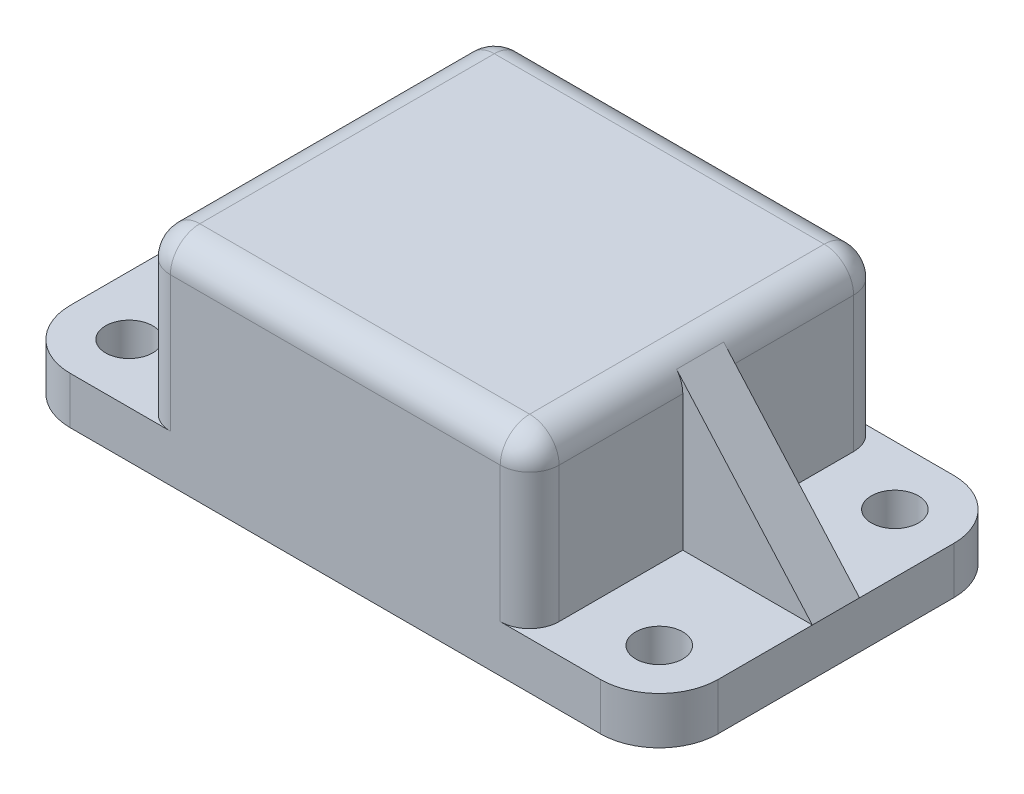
ISO-10303-21;
HEADER;
FILE_DESCRIPTION(('STEP AP214'),'2;1');
FILE_NAME('part.step','',(''),(''),'','','');
FILE_SCHEMA(('AUTOMOTIVE_DESIGN { 1 0 10303 214 1 1 1 1 }'));
ENDSEC;
DATA;
#1=APPLICATION_CONTEXT('core data for automotive mechanical design processes');
#2=APPLICATION_PROTOCOL_DEFINITION('international standard','automotive_design',2000,#1);
#3=PRODUCT_CONTEXT('',#1,'mechanical');
#4=PRODUCT('Part','Part','',(#3));
#5=PRODUCT_RELATED_PRODUCT_CATEGORY('part','',(#4));
#6=PRODUCT_DEFINITION_FORMATION('','',#4);
#7=PRODUCT_DEFINITION_CONTEXT('part definition',#1,'design');
#8=PRODUCT_DEFINITION('design','',#6,#7);
#9=PRODUCT_DEFINITION_SHAPE('','',#8);
#10=(LENGTH_UNIT() NAMED_UNIT(*) SI_UNIT(.MILLI.,.METRE.));
#11=(NAMED_UNIT(*) PLANE_ANGLE_UNIT() SI_UNIT($,.RADIAN.));
#12=(NAMED_UNIT(*) SI_UNIT($,.STERADIAN.) SOLID_ANGLE_UNIT());
#13=UNCERTAINTY_MEASURE_WITH_UNIT(LENGTH_MEASURE(1.E-05),#10,'distance_accuracy_value','');
#14=(GEOMETRIC_REPRESENTATION_CONTEXT(3) GLOBAL_UNCERTAINTY_ASSIGNED_CONTEXT((#13)) GLOBAL_UNIT_ASSIGNED_CONTEXT((#10,
#11,#12)) REPRESENTATION_CONTEXT('',''));
#15=CARTESIAN_POINT('',(0.,0.,0.));
#16=DIRECTION('',(0.,0.,1.));
#17=DIRECTION('',(1.,0.,0.));
#18=AXIS2_PLACEMENT_3D('',#15,#16,#17);
#19=CARTESIAN_POINT('',(-55.,0.,30.));
#20=DIRECTION('',(0.,1.,0.));
#21=DIRECTION('',(0.,0.,1.));
#22=AXIS2_PLACEMENT_3D('',#19,#20,#21);
#23=PLANE('',#22);
#24=CARTESIAN_POINT('',(-45.,0.,-20.));
#25=DIRECTION('',(0.,1.,0.));
#26=DIRECTION('',(0.,0.,1.));
#27=AXIS2_PLACEMENT_3D('',#24,#25,#26);
#28=CIRCLE('',#27,4.00000000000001);
#29=CARTESIAN_POINT('',(-45.,0.,-16.));
#30=VERTEX_POINT('',#29);
#31=EDGE_CURVE('E317',#30,#30,#28,.T.);
#32=ORIENTED_EDGE('',*,*,#31,.T.);
#33=EDGE_LOOP('',(#32));
#34=FACE_BOUND('',#33,.T.);
#35=CARTESIAN_POINT('',(45.,0.,-20.));
#36=DIRECTION('',(0.,1.,0.));
#37=DIRECTION('',(0.,0.,1.));
#38=AXIS2_PLACEMENT_3D('',#35,#36,#37);
#39=CIRCLE('',#38,4.00000000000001);
#40=CARTESIAN_POINT('',(45.,0.,-16.));
#41=VERTEX_POINT('',#40);
#42=EDGE_CURVE('E305',#41,#41,#39,.T.);
#43=ORIENTED_EDGE('',*,*,#42,.T.);
#44=EDGE_LOOP('',(#43));
#45=FACE_BOUND('',#44,.T.);
#46=DIRECTION('',(0.,0.,-1.));
#47=VECTOR('',#46,1.);
#48=CARTESIAN_POINT('',(-55.,0.,30.));
#49=LINE('',#48,#47);
#50=CARTESIAN_POINT('',(-55.,0.,20.));
#51=VERTEX_POINT('',#50);
#52=CARTESIAN_POINT('',(-55.,0.,-20.));
#53=VERTEX_POINT('',#52);
#54=EDGE_CURVE('E364',#51,#53,#49,.T.);
#55=ORIENTED_EDGE('',*,*,#54,.T.);
#56=CARTESIAN_POINT('',(-45.,0.,-20.));
#57=DIRECTION('',(0.,1.,0.));
#58=DIRECTION('',(0.,0.,1.));
#59=AXIS2_PLACEMENT_3D('',#56,#57,#58);
#60=CIRCLE('',#59,10.);
#61=CARTESIAN_POINT('',(-45.,0.,-30.));
#62=VERTEX_POINT('',#61);
#63=EDGE_CURVE('E379',#53,#62,#60,.F.);
#64=ORIENTED_EDGE('',*,*,#63,.T.);
#65=DIRECTION('',(1.,0.,0.));
#66=VECTOR('',#65,1.);
#67=CARTESIAN_POINT('',(-55.,0.,-30.));
#68=LINE('',#67,#66);
#69=CARTESIAN_POINT('',(45.,0.,-30.));
#70=VERTEX_POINT('',#69);
#71=EDGE_CURVE('E339',#62,#70,#68,.T.);
#72=ORIENTED_EDGE('',*,*,#71,.T.);
#73=CARTESIAN_POINT('',(45.,0.,-20.));
#74=DIRECTION('',(0.,1.,0.));
#75=DIRECTION('',(0.,0.,1.));
#76=AXIS2_PLACEMENT_3D('',#73,#74,#75);
#77=CIRCLE('',#76,10.);
#78=CARTESIAN_POINT('',(55.,0.,-20.));
#79=VERTEX_POINT('',#78);
#80=EDGE_CURVE('E385',#70,#79,#77,.F.);
#81=ORIENTED_EDGE('',*,*,#80,.T.);
#82=DIRECTION('',(0.,0.,-1.));
#83=VECTOR('',#82,1.);
#84=CARTESIAN_POINT('',(55.,0.,30.));
#85=LINE('',#84,#83);
#86=CARTESIAN_POINT('',(55.,0.,20.));
#87=VERTEX_POINT('',#86);
#88=EDGE_CURVE('E362',#87,#79,#85,.T.);
#89=ORIENTED_EDGE('',*,*,#88,.F.);
#90=CARTESIAN_POINT('',(45.,0.,20.));
#91=DIRECTION('',(0.,1.,0.));
#92=DIRECTION('',(0.,0.,1.));
#93=AXIS2_PLACEMENT_3D('',#90,#91,#92);
#94=CIRCLE('',#93,10.);
#95=CARTESIAN_POINT('',(45.,0.,30.));
#96=VERTEX_POINT('',#95);
#97=EDGE_CURVE('E383',#87,#96,#94,.F.);
#98=ORIENTED_EDGE('',*,*,#97,.T.);
#99=DIRECTION('',(1.,0.,0.));
#100=VECTOR('',#99,1.);
#101=CARTESIAN_POINT('',(-55.,0.,30.));
#102=LINE('',#101,#100);
#103=CARTESIAN_POINT('',(-45.,0.,30.));
#104=VERTEX_POINT('',#103);
#105=EDGE_CURVE('E329',#104,#96,#102,.T.);
#106=ORIENTED_EDGE('',*,*,#105,.F.);
#107=CARTESIAN_POINT('',(-45.,0.,20.));
#108=DIRECTION('',(0.,1.,0.));
#109=DIRECTION('',(0.,0.,1.));
#110=AXIS2_PLACEMENT_3D('',#107,#108,#109);
#111=CIRCLE('',#110,10.);
#112=EDGE_CURVE('E381',#104,#51,#111,.F.);
#113=ORIENTED_EDGE('',*,*,#112,.T.);
#114=EDGE_LOOP('',(#55,#64,#72,#81,#89,#98,#106,#113));
#115=FACE_BOUND('',#114,.T.);
#116=CARTESIAN_POINT('',(-45.,0.,20.));
#117=DIRECTION('',(0.,1.,0.));
#118=DIRECTION('',(0.,0.,1.));
#119=AXIS2_PLACEMENT_3D('',#116,#117,#118);
#120=CIRCLE('',#119,4.00000000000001);
#121=CARTESIAN_POINT('',(-45.,0.,24.));
#122=VERTEX_POINT('',#121);
#123=EDGE_CURVE('E323',#122,#122,#120,.T.);
#124=ORIENTED_EDGE('',*,*,#123,.T.);
#125=EDGE_LOOP('',(#124));
#126=FACE_BOUND('',#125,.T.);
#127=CARTESIAN_POINT('',(45.,0.,20.));
#128=DIRECTION('',(0.,1.,0.));
#129=DIRECTION('',(0.,0.,1.));
#130=AXIS2_PLACEMENT_3D('',#127,#128,#129);
#131=CIRCLE('',#130,4.00000000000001);
#132=CARTESIAN_POINT('',(45.,0.,24.));
#133=VERTEX_POINT('',#132);
#134=EDGE_CURVE('E311',#133,#133,#131,.T.);
#135=ORIENTED_EDGE('',*,*,#134,.T.);
#136=EDGE_LOOP('',(#135));
#137=FACE_BOUND('',#136,.T.);
#138=DIRECTION('',(0.,0.,1.));
#139=VECTOR('',#138,1.);
#140=CARTESIAN_POINT('',(-26.,0.,-24.));
#141=LINE('',#140,#139);
#142=CARTESIAN_POINT('',(-26.,0.,-24.));
#143=VERTEX_POINT('',#142);
#144=CARTESIAN_POINT('',(-26.,0.,24.));
#145=VERTEX_POINT('',#144);
#146=EDGE_CURVE('E51',#143,#145,#141,.T.);
#147=ORIENTED_EDGE('',*,*,#146,.T.);
#148=DIRECTION('',(1.,0.,0.));
#149=VECTOR('',#148,1.);
#150=CARTESIAN_POINT('',(-26.,0.,24.));
#151=LINE('',#150,#149);
#152=CARTESIAN_POINT('',(26.,0.,24.));
#153=VERTEX_POINT('',#152);
#154=EDGE_CURVE('E252',#145,#153,#151,.T.);
#155=ORIENTED_EDGE('',*,*,#154,.T.);
#156=DIRECTION('',(0.,0.,1.));
#157=VECTOR('',#156,1.);
#158=CARTESIAN_POINT('',(26.,0.,-24.));
#159=LINE('',#158,#157);
#160=CARTESIAN_POINT('',(26.,0.,-24.));
#161=VERTEX_POINT('',#160);
#162=EDGE_CURVE('E1021',#161,#153,#159,.T.);
#163=ORIENTED_EDGE('',*,*,#162,.F.);
#164=DIRECTION('',(1.,0.,0.));
#165=VECTOR('',#164,1.);
#166=CARTESIAN_POINT('',(-26.,0.,-24.));
#167=LINE('',#166,#165);
#168=EDGE_CURVE('E248',#143,#161,#167,.T.);
#169=ORIENTED_EDGE('',*,*,#168,.F.);
#170=EDGE_LOOP('',(#147,#155,#163,#169));
#171=FACE_BOUND('',#170,.T.);
#172=ADVANCED_FACE('F36',(#34,#45,#115,#126,#137,#171),#23,.F.);
#173=CARTESIAN_POINT('',(55.,8.,30.));
#174=DIRECTION('',(0.,-1.,0.));
#175=DIRECTION('',(1.,0.,0.));
#176=AXIS2_PLACEMENT_3D('',#173,#174,#175);
#177=PLANE('',#176);
#178=CARTESIAN_POINT('',(45.,8.00000000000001,-20.));
#179=DIRECTION('',(0.,1.,0.));
#180=DIRECTION('',(0.,0.,1.));
#181=AXIS2_PLACEMENT_3D('',#178,#179,#180);
#182=CIRCLE('',#181,4.00000000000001);
#183=CARTESIAN_POINT('',(45.,8.00000000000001,-16.));
#184=VERTEX_POINT('',#183);
#185=EDGE_CURVE('E304',#184,#184,#182,.T.);
#186=ORIENTED_EDGE('',*,*,#185,.F.);
#187=EDGE_LOOP('',(#186));
#188=FACE_BOUND('',#187,.T.);
#189=DIRECTION('',(-1.,0.,0.));
#190=VECTOR('',#189,1.);
#191=CARTESIAN_POINT('',(55.,8.,-4.));
#192=LINE('',#191,#190);
#193=CARTESIAN_POINT('',(55.,8.,-4.));
#194=VERTEX_POINT('',#193);
#195=CARTESIAN_POINT('',(33.,8.,-4.));
#196=VERTEX_POINT('',#195);
#197=EDGE_CURVE('E264',#194,#196,#192,.T.);
#198=ORIENTED_EDGE('',*,*,#197,.F.);
#199=DIRECTION('',(0.,0.,-1.));
#200=VECTOR('',#199,1.);
#201=CARTESIAN_POINT('',(55.,8.,30.));
#202=LINE('',#201,#200);
#203=CARTESIAN_POINT('',(55.,8.,-20.));
#204=VERTEX_POINT('',#203);
#205=EDGE_CURVE('E358',#194,#204,#202,.T.);
#206=ORIENTED_EDGE('',*,*,#205,.T.);
#207=CARTESIAN_POINT('',(45.,8.,-20.));
#208=DIRECTION('',(0.,-1.,0.));
#209=DIRECTION('',(1.,0.,0.));
#210=AXIS2_PLACEMENT_3D('',#207,#208,#209);
#211=CIRCLE('',#210,10.);
#212=CARTESIAN_POINT('',(45.,8.,-30.));
#213=VERTEX_POINT('',#212);
#214=EDGE_CURVE('E373',#204,#213,#211,.F.);
#215=ORIENTED_EDGE('',*,*,#214,.T.);
#216=DIRECTION('',(-1.,0.,0.));
#217=VECTOR('',#216,1.);
#218=CARTESIAN_POINT('',(55.,8.,-30.));
#219=LINE('',#218,#217);
#220=CARTESIAN_POINT('',(28.,8.,-30.));
#221=VERTEX_POINT('',#220);
#222=EDGE_CURVE('E342',#213,#221,#219,.T.);
#223=ORIENTED_EDGE('',*,*,#222,.T.);
#224=CARTESIAN_POINT('',(28.,8.,-25.));
#225=DIRECTION('',(0.,-1.,0.));
#226=DIRECTION('',(1.,0.,0.));
#227=AXIS2_PLACEMENT_3D('',#224,#225,#226);
#228=CIRCLE('',#227,5.);
#229=CARTESIAN_POINT('',(33.,8.,-25.));
#230=VERTEX_POINT('',#229);
#231=EDGE_CURVE('E448',#221,#230,#228,.T.);
#232=ORIENTED_EDGE('',*,*,#231,.T.);
#233=DIRECTION('',(0.,0.,-1.));
#234=VECTOR('',#233,1.);
#235=CARTESIAN_POINT('',(33.,8.,30.));
#236=LINE('',#235,#234);
#237=EDGE_CURVE('E354',#196,#230,#236,.T.);
#238=ORIENTED_EDGE('',*,*,#237,.F.);
#239=EDGE_LOOP('',(#198,#206,#215,#223,#232,#238));
#240=FACE_BOUND('',#239,.T.);
#241=ADVANCED_FACE('F559',(#188,#240),#177,.F.);
#242=CARTESIAN_POINT('',(33.,8.,30.));
#243=DIRECTION('',(-1.,0.,0.));
#244=DIRECTION('',(0.,0.,1.));
#245=AXIS2_PLACEMENT_3D('',#242,#243,#244);
#246=PLANE('',#245);
#247=DIRECTION('',(0.,1.,0.));
#248=VECTOR('',#247,1.);
#249=CARTESIAN_POINT('',(33.,8.,-4.));
#250=LINE('',#249,#248);
#251=CARTESIAN_POINT('',(33.,31.,-4.));
#252=VERTEX_POINT('',#251);
#253=EDGE_CURVE('E59',#196,#252,#250,.T.);
#254=ORIENTED_EDGE('',*,*,#253,.F.);
#255=ORIENTED_EDGE('',*,*,#237,.T.);
#256=DIRECTION('',(0.,1.,0.));
#257=VECTOR('',#256,1.);
#258=CARTESIAN_POINT('',(33.,8.,-25.));
#259=LINE('',#258,#257);
#260=CARTESIAN_POINT('',(33.,31.,-25.));
#261=VERTEX_POINT('',#260);
#262=EDGE_CURVE('E418',#230,#261,#259,.T.);
#263=ORIENTED_EDGE('',*,*,#262,.T.);
#264=DIRECTION('',(0.,0.,-1.));
#265=VECTOR('',#264,1.);
#266=CARTESIAN_POINT('',(33.,31.,30.));
#267=LINE('',#266,#265);
#268=EDGE_CURVE('E415',#261,#252,#267,.F.);
#269=ORIENTED_EDGE('',*,*,#268,.T.);
#270=EDGE_LOOP('',(#254,#255,#263,#269));
#271=FACE_BOUND('',#270,.T.);
#272=ADVANCED_FACE('F614',(#271),#246,.F.);
#273=CARTESIAN_POINT('',(-33.,36.,30.));
#274=DIRECTION('',(1.,0.,0.));
#275=DIRECTION('',(0.,0.,-1.));
#276=AXIS2_PLACEMENT_3D('',#273,#274,#275);
#277=PLANE('',#276);
#278=DIRECTION('',(0.,-1.,0.));
#279=VECTOR('',#278,1.);
#280=CARTESIAN_POINT('',(-33.,36.,-4.));
#281=LINE('',#280,#279);
#282=CARTESIAN_POINT('',(-33.,31.,-4.));
#283=VERTEX_POINT('',#282);
#284=CARTESIAN_POINT('',(-33.,8.,-4.));
#285=VERTEX_POINT('',#284);
#286=EDGE_CURVE('E291',#283,#285,#281,.T.);
#287=ORIENTED_EDGE('',*,*,#286,.F.);
#288=DIRECTION('',(0.,0.,-1.));
#289=VECTOR('',#288,1.);
#290=CARTESIAN_POINT('',(-33.,31.,30.));
#291=LINE('',#290,#289);
#292=CARTESIAN_POINT('',(-33.,31.,-25.));
#293=VERTEX_POINT('',#292);
#294=EDGE_CURVE('E423',#283,#293,#291,.T.);
#295=ORIENTED_EDGE('',*,*,#294,.T.);
#296=DIRECTION('',(0.,-1.,0.));
#297=VECTOR('',#296,1.);
#298=CARTESIAN_POINT('',(-33.,36.,-25.));
#299=LINE('',#298,#297);
#300=CARTESIAN_POINT('',(-33.,8.,-25.));
#301=VERTEX_POINT('',#300);
#302=EDGE_CURVE('E420',#293,#301,#299,.T.);
#303=ORIENTED_EDGE('',*,*,#302,.T.);
#304=DIRECTION('',(0.,0.,-1.));
#305=VECTOR('',#304,1.);
#306=CARTESIAN_POINT('',(-33.,8.,30.));
#307=LINE('',#306,#305);
#308=EDGE_CURVE('E350',#285,#301,#307,.T.);
#309=ORIENTED_EDGE('',*,*,#308,.F.);
#310=EDGE_LOOP('',(#287,#295,#303,#309));
#311=FACE_BOUND('',#310,.T.);
#312=ADVANCED_FACE('F506',(#311),#277,.F.);
#313=CARTESIAN_POINT('',(-33.,8.,30.));
#314=DIRECTION('',(0.,-1.,0.));
#315=DIRECTION('',(0.,0.,-1.));
#316=AXIS2_PLACEMENT_3D('',#313,#314,#315);
#317=PLANE('',#316);
#318=CARTESIAN_POINT('',(-45.,8.,-20.));
#319=DIRECTION('',(0.,1.,0.));
#320=DIRECTION('',(0.,0.,1.));
#321=AXIS2_PLACEMENT_3D('',#318,#319,#320);
#322=CIRCLE('',#321,4.00000000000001);
#323=CARTESIAN_POINT('',(-45.,8.,-16.));
#324=VERTEX_POINT('',#323);
#325=EDGE_CURVE('E314',#324,#324,#322,.T.);
#326=ORIENTED_EDGE('',*,*,#325,.F.);
#327=EDGE_LOOP('',(#326));
#328=FACE_BOUND('',#327,.T.);
#329=DIRECTION('',(-1.,0.,0.));
#330=VECTOR('',#329,1.);
#331=CARTESIAN_POINT('',(-33.,8.,-4.));
#332=LINE('',#331,#330);
#333=CARTESIAN_POINT('',(-55.,8.,-4.));
#334=VERTEX_POINT('',#333);
#335=EDGE_CURVE('E285',#285,#334,#332,.T.);
#336=ORIENTED_EDGE('',*,*,#335,.F.);
#337=ORIENTED_EDGE('',*,*,#308,.T.);
#338=CARTESIAN_POINT('',(-28.,8.,-25.));
#339=DIRECTION('',(0.,-1.,0.));
#340=DIRECTION('',(0.,0.,-1.));
#341=AXIS2_PLACEMENT_3D('',#338,#339,#340);
#342=CIRCLE('',#341,5.);
#343=CARTESIAN_POINT('',(-28.,8.,-30.));
#344=VERTEX_POINT('',#343);
#345=EDGE_CURVE('E445',#301,#344,#342,.T.);
#346=ORIENTED_EDGE('',*,*,#345,.T.);
#347=DIRECTION('',(-1.,0.,0.));
#348=VECTOR('',#347,1.);
#349=CARTESIAN_POINT('',(-33.,8.,-30.));
#350=LINE('',#349,#348);
#351=CARTESIAN_POINT('',(-45.,8.,-30.));
#352=VERTEX_POINT('',#351);
#353=EDGE_CURVE('E333',#344,#352,#350,.T.);
#354=ORIENTED_EDGE('',*,*,#353,.T.);
#355=CARTESIAN_POINT('',(-45.,8.,-20.));
#356=DIRECTION('',(0.,-1.,0.));
#357=DIRECTION('',(0.,0.,-1.));
#358=AXIS2_PLACEMENT_3D('',#355,#356,#357);
#359=CIRCLE('',#358,10.);
#360=CARTESIAN_POINT('',(-55.,8.,-20.));
#361=VERTEX_POINT('',#360);
#362=EDGE_CURVE('E399',#352,#361,#359,.F.);
#363=ORIENTED_EDGE('',*,*,#362,.T.);
#364=DIRECTION('',(0.,0.,-1.));
#365=VECTOR('',#364,1.);
#366=CARTESIAN_POINT('',(-55.,8.,30.));
#367=LINE('',#366,#365);
#368=EDGE_CURVE('E338',#334,#361,#367,.T.);
#369=ORIENTED_EDGE('',*,*,#368,.F.);
#370=EDGE_LOOP('',(#336,#337,#346,#354,#363,#369));
#371=FACE_BOUND('',#370,.T.);
#372=ADVANCED_FACE('F510',(#328,#371),#317,.F.);
#373=CARTESIAN_POINT('',(-55.,8.,30.));
#374=DIRECTION('',(1.,0.,0.));
#375=DIRECTION('',(0.,0.,-1.));
#376=AXIS2_PLACEMENT_3D('',#373,#374,#375);
#377=PLANE('',#376);
#378=CARTESIAN_POINT('',(-55.,8.,20.));
#379=VERTEX_POINT('',#378);
#380=CARTESIAN_POINT('',(-55.,8.,4.));
#381=VERTEX_POINT('',#380);
#382=EDGE_CURVE('E347',#379,#381,#367,.T.);
#383=ORIENTED_EDGE('',*,*,#382,.T.);
#384=DIRECTION('',(0.,0.,1.));
#385=VECTOR('',#384,1.);
#386=CARTESIAN_POINT('',(-55.,8.,30.));
#387=LINE('',#386,#385);
#388=EDGE_CURVE('E296',#381,#334,#387,.F.);
#389=ORIENTED_EDGE('',*,*,#388,.T.);
#390=ORIENTED_EDGE('',*,*,#368,.T.);
#391=DIRECTION('',(0.,-1.,0.));
#392=VECTOR('',#391,1.);
#393=CARTESIAN_POINT('',(-55.,8.,-20.));
#394=LINE('',#393,#392);
#395=EDGE_CURVE('E394',#361,#53,#394,.T.);
#396=ORIENTED_EDGE('',*,*,#395,.T.);
#397=ORIENTED_EDGE('',*,*,#54,.F.);
#398=DIRECTION('',(0.,-1.,0.));
#399=VECTOR('',#398,1.);
#400=CARTESIAN_POINT('',(-55.,8.,20.));
#401=LINE('',#400,#399);
#402=EDGE_CURVE('E397',#51,#379,#401,.F.);
#403=ORIENTED_EDGE('',*,*,#402,.T.);
#404=EDGE_LOOP('',(#383,#389,#390,#396,#397,#403));
#405=FACE_BOUND('',#404,.T.);
#406=ADVANCED_FACE('F515',(#405),#377,.F.);
#407=CARTESIAN_POINT('',(55.,0.,30.));
#408=DIRECTION('',(-1.,0.,0.));
#409=DIRECTION('',(0.,0.,1.));
#410=AXIS2_PLACEMENT_3D('',#407,#408,#409);
#411=PLANE('',#410);
#412=ORIENTED_EDGE('',*,*,#88,.T.);
#413=DIRECTION('',(0.,1.,0.));
#414=VECTOR('',#413,1.);
#415=CARTESIAN_POINT('',(55.,0.,-20.));
#416=LINE('',#415,#414);
#417=EDGE_CURVE('E368',#79,#204,#416,.T.);
#418=ORIENTED_EDGE('',*,*,#417,.T.);
#419=ORIENTED_EDGE('',*,*,#205,.F.);
#420=DIRECTION('',(0.,0.,1.));
#421=VECTOR('',#420,1.);
#422=CARTESIAN_POINT('',(55.,8.,30.));
#423=LINE('',#422,#421);
#424=CARTESIAN_POINT('',(55.,8.,4.));
#425=VERTEX_POINT('',#424);
#426=EDGE_CURVE('E278',#194,#425,#423,.T.);
#427=ORIENTED_EDGE('',*,*,#426,.T.);
#428=CARTESIAN_POINT('',(55.,8.,20.));
#429=VERTEX_POINT('',#428);
#430=EDGE_CURVE('E359',#429,#425,#202,.T.);
#431=ORIENTED_EDGE('',*,*,#430,.F.);
#432=DIRECTION('',(0.,1.,0.));
#433=VECTOR('',#432,1.);
#434=CARTESIAN_POINT('',(55.,0.,20.));
#435=LINE('',#434,#433);
#436=EDGE_CURVE('E366',#429,#87,#435,.F.);
#437=ORIENTED_EDGE('',*,*,#436,.T.);
#438=EDGE_LOOP('',(#412,#418,#419,#427,#431,#437));
#439=FACE_BOUND('',#438,.T.);
#440=ADVANCED_FACE('F626',(#439),#411,.F.);
#441=CARTESIAN_POINT('',(45.,8.00000000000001,20.));
#442=DIRECTION('',(0.,1.,0.));
#443=DIRECTION('',(0.,0.,1.));
#444=AXIS2_PLACEMENT_3D('',#441,#442,#443);
#445=CIRCLE('',#444,4.00000000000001);
#446=CARTESIAN_POINT('',(45.,8.00000000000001,24.));
#447=VERTEX_POINT('',#446);
#448=EDGE_CURVE('E308',#447,#447,#445,.T.);
#449=ORIENTED_EDGE('',*,*,#448,.F.);
#450=EDGE_LOOP('',(#449));
#451=FACE_BOUND('',#450,.T.);
#452=ORIENTED_EDGE('',*,*,#430,.T.);
#453=DIRECTION('',(-1.,0.,0.));
#454=VECTOR('',#453,1.);
#455=CARTESIAN_POINT('',(55.,8.,4.));
#456=LINE('',#455,#454);
#457=CARTESIAN_POINT('',(33.,8.,4.));
#458=VERTEX_POINT('',#457);
#459=EDGE_CURVE('E268',#425,#458,#456,.T.);
#460=ORIENTED_EDGE('',*,*,#459,.T.);
#461=CARTESIAN_POINT('',(33.,8.,25.));
#462=VERTEX_POINT('',#461);
#463=EDGE_CURVE('E355',#462,#458,#236,.T.);
#464=ORIENTED_EDGE('',*,*,#463,.F.);
#465=CARTESIAN_POINT('',(28.,8.,25.));
#466=DIRECTION('',(0.,-1.,0.));
#467=DIRECTION('',(1.,0.,0.));
#468=AXIS2_PLACEMENT_3D('',#465,#466,#467);
#469=CIRCLE('',#468,5.);
#470=CARTESIAN_POINT('',(28.,8.,30.));
#471=VERTEX_POINT('',#470);
#472=EDGE_CURVE('E451',#462,#471,#469,.T.);
#473=ORIENTED_EDGE('',*,*,#472,.T.);
#474=DIRECTION('',(-1.,0.,0.));
#475=VECTOR('',#474,1.);
#476=CARTESIAN_POINT('',(55.,8.,30.));
#477=LINE('',#476,#475);
#478=CARTESIAN_POINT('',(45.,8.,30.));
#479=VERTEX_POINT('',#478);
#480=EDGE_CURVE('E332',#479,#471,#477,.T.);
#481=ORIENTED_EDGE('',*,*,#480,.F.);
#482=CARTESIAN_POINT('',(45.,8.,20.));
#483=DIRECTION('',(0.,-1.,0.));
#484=DIRECTION('',(1.,0.,0.));
#485=AXIS2_PLACEMENT_3D('',#482,#483,#484);
#486=CIRCLE('',#485,10.);
#487=EDGE_CURVE('E371',#479,#429,#486,.F.);
#488=ORIENTED_EDGE('',*,*,#487,.T.);
#489=EDGE_LOOP('',(#452,#460,#464,#473,#481,#488));
#490=FACE_BOUND('',#489,.T.);
#491=ADVANCED_FACE('F611',(#451,#490),#177,.F.);
#492=ORIENTED_EDGE('',*,*,#463,.T.);
#493=DIRECTION('',(0.,1.,0.));
#494=VECTOR('',#493,1.);
#495=CARTESIAN_POINT('',(33.,8.,4.));
#496=LINE('',#495,#494);
#497=CARTESIAN_POINT('',(33.,31.,4.));
#498=VERTEX_POINT('',#497);
#499=EDGE_CURVE('E273',#458,#498,#496,.T.);
#500=ORIENTED_EDGE('',*,*,#499,.T.);
#501=CARTESIAN_POINT('',(33.,31.,25.));
#502=VERTEX_POINT('',#501);
#503=EDGE_CURVE('E414',#498,#502,#267,.F.);
#504=ORIENTED_EDGE('',*,*,#503,.T.);
#505=DIRECTION('',(0.,1.,0.));
#506=VECTOR('',#505,1.);
#507=CARTESIAN_POINT('',(33.,8.,25.));
#508=LINE('',#507,#506);
#509=EDGE_CURVE('E412',#502,#462,#508,.F.);
#510=ORIENTED_EDGE('',*,*,#509,.T.);
#511=EDGE_LOOP('',(#492,#500,#504,#510));
#512=FACE_BOUND('',#511,.T.);
#513=ADVANCED_FACE('F604',(#512),#246,.F.);
#514=CARTESIAN_POINT('',(33.,36.,30.));
#515=DIRECTION('',(0.,-1.,0.));
#516=DIRECTION('',(1.,0.,0.));
#517=AXIS2_PLACEMENT_3D('',#514,#515,#516);
#518=PLANE('',#517);
#519=DIRECTION('',(0.,0.,-1.));
#520=VECTOR('',#519,1.);
#521=CARTESIAN_POINT('',(28.,36.,30.));
#522=LINE('',#521,#520);
#523=CARTESIAN_POINT('',(28.,36.,25.));
#524=VERTEX_POINT('',#523);
#525=CARTESIAN_POINT('',(28.,36.,-25.));
#526=VERTEX_POINT('',#525);
#527=EDGE_CURVE('E408',#524,#526,#522,.T.);
#528=ORIENTED_EDGE('',*,*,#527,.T.);
#529=DIRECTION('',(-1.,0.,0.));
#530=VECTOR('',#529,1.);
#531=CARTESIAN_POINT('',(33.,36.,-25.));
#532=LINE('',#531,#530);
#533=CARTESIAN_POINT('',(-28.,36.,-25.));
#534=VERTEX_POINT('',#533);
#535=EDGE_CURVE('E404',#526,#534,#532,.T.);
#536=ORIENTED_EDGE('',*,*,#535,.T.);
#537=DIRECTION('',(0.,0.,-1.));
#538=VECTOR('',#537,1.);
#539=CARTESIAN_POINT('',(-28.,36.,30.));
#540=LINE('',#539,#538);
#541=CARTESIAN_POINT('',(-28.,36.,25.));
#542=VERTEX_POINT('',#541);
#543=EDGE_CURVE('E406',#534,#542,#540,.F.);
#544=ORIENTED_EDGE('',*,*,#543,.T.);
#545=DIRECTION('',(-1.,0.,0.));
#546=VECTOR('',#545,1.);
#547=CARTESIAN_POINT('',(33.,36.,25.));
#548=LINE('',#547,#546);
#549=EDGE_CURVE('E410',#542,#524,#548,.F.);
#550=ORIENTED_EDGE('',*,*,#549,.T.);
#551=EDGE_LOOP('',(#528,#536,#544,#550));
#552=FACE_BOUND('',#551,.T.);
#553=ADVANCED_FACE('F602',(#552),#518,.F.);
#554=CARTESIAN_POINT('',(-33.,31.,25.));
#555=VERTEX_POINT('',#554);
#556=CARTESIAN_POINT('',(-33.,31.,4.));
#557=VERTEX_POINT('',#556);
#558=EDGE_CURVE('E424',#555,#557,#291,.T.);
#559=ORIENTED_EDGE('',*,*,#558,.T.);
#560=DIRECTION('',(0.,-1.,0.));
#561=VECTOR('',#560,1.);
#562=CARTESIAN_POINT('',(-33.,36.,4.));
#563=LINE('',#562,#561);
#564=CARTESIAN_POINT('',(-33.,8.,4.));
#565=VERTEX_POINT('',#564);
#566=EDGE_CURVE('E297',#557,#565,#563,.T.);
#567=ORIENTED_EDGE('',*,*,#566,.T.);
#568=CARTESIAN_POINT('',(-33.,8.,25.));
#569=VERTEX_POINT('',#568);
#570=EDGE_CURVE('E351',#569,#565,#307,.T.);
#571=ORIENTED_EDGE('',*,*,#570,.F.);
#572=DIRECTION('',(0.,-1.,0.));
#573=VECTOR('',#572,1.);
#574=CARTESIAN_POINT('',(-33.,36.,25.));
#575=LINE('',#574,#573);
#576=EDGE_CURVE('E427',#569,#555,#575,.F.);
#577=ORIENTED_EDGE('',*,*,#576,.T.);
#578=EDGE_LOOP('',(#559,#567,#571,#577));
#579=FACE_BOUND('',#578,.T.);
#580=ADVANCED_FACE('F526',(#579),#277,.F.);
#581=CARTESIAN_POINT('',(-45.,8.,20.));
#582=DIRECTION('',(0.,1.,0.));
#583=DIRECTION('',(0.,0.,1.));
#584=AXIS2_PLACEMENT_3D('',#581,#582,#583);
#585=CIRCLE('',#584,4.00000000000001);
#586=CARTESIAN_POINT('',(-45.,8.,24.));
#587=VERTEX_POINT('',#586);
#588=EDGE_CURVE('E320',#587,#587,#585,.T.);
#589=ORIENTED_EDGE('',*,*,#588,.F.);
#590=EDGE_LOOP('',(#589));
#591=FACE_BOUND('',#590,.T.);
#592=ORIENTED_EDGE('',*,*,#570,.T.);
#593=DIRECTION('',(-1.,0.,0.));
#594=VECTOR('',#593,1.);
#595=CARTESIAN_POINT('',(-33.,8.,4.));
#596=LINE('',#595,#594);
#597=EDGE_CURVE('E290',#565,#381,#596,.T.);
#598=ORIENTED_EDGE('',*,*,#597,.T.);
#599=ORIENTED_EDGE('',*,*,#382,.F.);
#600=CARTESIAN_POINT('',(-45.,8.,20.));
#601=DIRECTION('',(0.,-1.,0.));
#602=DIRECTION('',(0.,0.,-1.));
#603=AXIS2_PLACEMENT_3D('',#600,#601,#602);
#604=CIRCLE('',#603,10.);
#605=CARTESIAN_POINT('',(-45.,8.,30.));
#606=VERTEX_POINT('',#605);
#607=EDGE_CURVE('E402',#379,#606,#604,.F.);
#608=ORIENTED_EDGE('',*,*,#607,.T.);
#609=DIRECTION('',(-1.,0.,0.));
#610=VECTOR('',#609,1.);
#611=CARTESIAN_POINT('',(-33.,8.,30.));
#612=LINE('',#611,#610);
#613=CARTESIAN_POINT('',(-28.,8.,30.));
#614=VERTEX_POINT('',#613);
#615=EDGE_CURVE('E335',#614,#606,#612,.T.);
#616=ORIENTED_EDGE('',*,*,#615,.F.);
#617=CARTESIAN_POINT('',(-28.,8.,25.));
#618=DIRECTION('',(0.,-1.,0.));
#619=DIRECTION('',(0.,0.,-1.));
#620=AXIS2_PLACEMENT_3D('',#617,#618,#619);
#621=CIRCLE('',#620,5.);
#622=EDGE_CURVE('E443',#614,#569,#621,.T.);
#623=ORIENTED_EDGE('',*,*,#622,.T.);
#624=EDGE_LOOP('',(#592,#598,#599,#608,#616,#623));
#625=FACE_BOUND('',#624,.T.);
#626=ADVANCED_FACE('F520',(#591,#625),#317,.F.);
#627=CARTESIAN_POINT('',(0.,0.,30.));
#628=DIRECTION('',(0.,0.,1.));
#629=DIRECTION('',(1.,0.,0.));
#630=AXIS2_PLACEMENT_3D('',#627,#628,#629);
#631=PLANE('',#630);
#632=DIRECTION('',(0.,-1.,0.));
#633=VECTOR('',#632,1.);
#634=CARTESIAN_POINT('',(-28.,8.,30.));
#635=LINE('',#634,#633);
#636=CARTESIAN_POINT('',(-28.,31.,30.));
#637=VERTEX_POINT('',#636);
#638=EDGE_CURVE('E433',#637,#614,#635,.T.);
#639=ORIENTED_EDGE('',*,*,#638,.T.);
#640=ORIENTED_EDGE('',*,*,#615,.T.);
#641=DIRECTION('',(0.,-1.,0.));
#642=VECTOR('',#641,1.);
#643=CARTESIAN_POINT('',(-45.,0.,30.));
#644=LINE('',#643,#642);
#645=EDGE_CURVE('E388',#606,#104,#644,.T.);
#646=ORIENTED_EDGE('',*,*,#645,.T.);
#647=ORIENTED_EDGE('',*,*,#105,.T.);
#648=DIRECTION('',(0.,1.,0.));
#649=VECTOR('',#648,1.);
#650=CARTESIAN_POINT('',(45.,8.,30.));
#651=LINE('',#650,#649);
#652=EDGE_CURVE('E391',#96,#479,#651,.T.);
#653=ORIENTED_EDGE('',*,*,#652,.T.);
#654=ORIENTED_EDGE('',*,*,#480,.T.);
#655=DIRECTION('',(0.,1.,0.));
#656=VECTOR('',#655,1.);
#657=CARTESIAN_POINT('',(28.,36.,30.));
#658=LINE('',#657,#656);
#659=CARTESIAN_POINT('',(28.,31.,30.));
#660=VERTEX_POINT('',#659);
#661=EDGE_CURVE('E429',#471,#660,#658,.T.);
#662=ORIENTED_EDGE('',*,*,#661,.T.);
#663=DIRECTION('',(-1.,0.,0.));
#664=VECTOR('',#663,1.);
#665=CARTESIAN_POINT('',(-33.,31.,30.));
#666=LINE('',#665,#664);
#667=EDGE_CURVE('E431',#660,#637,#666,.T.);
#668=ORIENTED_EDGE('',*,*,#667,.T.);
#669=EDGE_LOOP('',(#639,#640,#646,#647,#653,#654,#662,#668));
#670=FACE_BOUND('',#669,.T.);
#671=ADVANCED_FACE('F581',(#670),#631,.T.);
#672=CARTESIAN_POINT('',(0.,0.,-30.));
#673=DIRECTION('',(0.,0.,1.));
#674=DIRECTION('',(1.,0.,0.));
#675=AXIS2_PLACEMENT_3D('',#672,#673,#674);
#676=PLANE('',#675);
#677=ORIENTED_EDGE('',*,*,#353,.F.);
#678=DIRECTION('',(0.,-1.,0.));
#679=VECTOR('',#678,1.);
#680=CARTESIAN_POINT('',(-28.,0.,-30.));
#681=LINE('',#680,#679);
#682=CARTESIAN_POINT('',(-28.,31.,-30.));
#683=VERTEX_POINT('',#682);
#684=EDGE_CURVE('E441',#344,#683,#681,.F.);
#685=ORIENTED_EDGE('',*,*,#684,.T.);
#686=DIRECTION('',(-1.,0.,0.));
#687=VECTOR('',#686,1.);
#688=CARTESIAN_POINT('',(0.,31.,-30.));
#689=LINE('',#688,#687);
#690=CARTESIAN_POINT('',(28.,31.,-30.));
#691=VERTEX_POINT('',#690);
#692=EDGE_CURVE('E439',#683,#691,#689,.F.);
#693=ORIENTED_EDGE('',*,*,#692,.T.);
#694=DIRECTION('',(0.,1.,0.));
#695=VECTOR('',#694,1.);
#696=CARTESIAN_POINT('',(28.,0.,-30.));
#697=LINE('',#696,#695);
#698=EDGE_CURVE('E436',#691,#221,#697,.F.);
#699=ORIENTED_EDGE('',*,*,#698,.T.);
#700=ORIENTED_EDGE('',*,*,#222,.F.);
#701=DIRECTION('',(0.,1.,0.));
#702=VECTOR('',#701,1.);
#703=CARTESIAN_POINT('',(45.,0.,-30.));
#704=LINE('',#703,#702);
#705=EDGE_CURVE('E377',#213,#70,#704,.F.);
#706=ORIENTED_EDGE('',*,*,#705,.T.);
#707=ORIENTED_EDGE('',*,*,#71,.F.);
#708=DIRECTION('',(0.,-1.,0.));
#709=VECTOR('',#708,1.);
#710=CARTESIAN_POINT('',(-45.,0.,-30.));
#711=LINE('',#710,#709);
#712=EDGE_CURVE('E375',#62,#352,#711,.F.);
#713=ORIENTED_EDGE('',*,*,#712,.T.);
#714=EDGE_LOOP('',(#677,#685,#693,#699,#700,#706,#707,#713));
#715=FACE_BOUND('',#714,.T.);
#716=ADVANCED_FACE('F548',(#715),#676,.F.);
#717=CARTESIAN_POINT('',(45.,0.,-20.));
#718=DIRECTION('',(0.,1.,0.));
#719=DIRECTION('',(0.,0.,1.));
#720=AXIS2_PLACEMENT_3D('',#717,#718,#719);
#721=CYLINDRICAL_SURFACE('',#720,10.);
#722=ORIENTED_EDGE('',*,*,#80,.F.);
#723=ORIENTED_EDGE('',*,*,#705,.F.);
#724=ORIENTED_EDGE('',*,*,#214,.F.);
#725=ORIENTED_EDGE('',*,*,#417,.F.);
#726=EDGE_LOOP('',(#722,#723,#724,#725));
#727=FACE_BOUND('',#726,.T.);
#728=ADVANCED_FACE('F565',(#727),#721,.T.);
#729=CARTESIAN_POINT('',(45.,0.,20.));
#730=DIRECTION('',(0.,-1.,0.));
#731=DIRECTION('',(0.,0.,-1.));
#732=AXIS2_PLACEMENT_3D('',#729,#730,#731);
#733=CYLINDRICAL_SURFACE('',#732,10.);
#734=ORIENTED_EDGE('',*,*,#97,.F.);
#735=ORIENTED_EDGE('',*,*,#436,.F.);
#736=ORIENTED_EDGE('',*,*,#487,.F.);
#737=ORIENTED_EDGE('',*,*,#652,.F.);
#738=EDGE_LOOP('',(#734,#735,#736,#737));
#739=FACE_BOUND('',#738,.T.);
#740=ADVANCED_FACE('F631',(#739),#733,.T.);
#741=CARTESIAN_POINT('',(-45.,0.,20.));
#742=DIRECTION('',(0.,1.,0.));
#743=DIRECTION('',(0.,0.,1.));
#744=AXIS2_PLACEMENT_3D('',#741,#742,#743);
#745=CYLINDRICAL_SURFACE('',#744,10.);
#746=ORIENTED_EDGE('',*,*,#607,.F.);
#747=ORIENTED_EDGE('',*,*,#402,.F.);
#748=ORIENTED_EDGE('',*,*,#112,.F.);
#749=ORIENTED_EDGE('',*,*,#645,.F.);
#750=EDGE_LOOP('',(#746,#747,#748,#749));
#751=FACE_BOUND('',#750,.T.);
#752=ADVANCED_FACE('F578',(#751),#745,.T.);
#753=CARTESIAN_POINT('',(-45.,8.,-20.));
#754=DIRECTION('',(0.,-1.,0.));
#755=DIRECTION('',(0.,0.,-1.));
#756=AXIS2_PLACEMENT_3D('',#753,#754,#755);
#757=CYLINDRICAL_SURFACE('',#756,10.);
#758=ORIENTED_EDGE('',*,*,#362,.F.);
#759=ORIENTED_EDGE('',*,*,#712,.F.);
#760=ORIENTED_EDGE('',*,*,#63,.F.);
#761=ORIENTED_EDGE('',*,*,#395,.F.);
#762=EDGE_LOOP('',(#758,#759,#760,#761));
#763=FACE_BOUND('',#762,.T.);
#764=ADVANCED_FACE('F574',(#763),#757,.T.);
#765=CARTESIAN_POINT('',(-28.,0.,25.));
#766=DIRECTION('',(0.,1.,0.));
#767=DIRECTION('',(0.,0.,1.));
#768=AXIS2_PLACEMENT_3D('',#765,#766,#767);
#769=CYLINDRICAL_SURFACE('',#768,5.);
#770=ORIENTED_EDGE('',*,*,#622,.F.);
#771=ORIENTED_EDGE('',*,*,#638,.F.);
#772=CARTESIAN_POINT('',(-28.,31.,25.));
#773=DIRECTION('',(0.,1.,0.));
#774=DIRECTION('',(0.,0.,1.));
#775=AXIS2_PLACEMENT_3D('',#772,#773,#774);
#776=CIRCLE('',#775,5.);
#777=EDGE_CURVE('E343',#555,#637,#776,.T.);
#778=ORIENTED_EDGE('',*,*,#777,.F.);
#779=ORIENTED_EDGE('',*,*,#576,.F.);
#780=EDGE_LOOP('',(#770,#771,#778,#779));
#781=FACE_BOUND('',#780,.T.);
#782=ADVANCED_FACE('F38',(#781),#769,.T.);
#783=CARTESIAN_POINT('',(-28.,31.,30.));
#784=DIRECTION('',(0.,0.,-1.));
#785=DIRECTION('',(-1.,0.,0.));
#786=AXIS2_PLACEMENT_3D('',#783,#784,#785);
#787=CYLINDRICAL_SURFACE('',#786,5.);
#788=CARTESIAN_POINT('',(-28.,31.,25.));
#789=DIRECTION('',(0.,0.,1.));
#790=DIRECTION('',(1.,0.,0.));
#791=AXIS2_PLACEMENT_3D('',#788,#789,#790);
#792=CIRCLE('',#791,5.);
#793=EDGE_CURVE('E483',#542,#555,#792,.T.);
#794=ORIENTED_EDGE('',*,*,#793,.F.);
#795=ORIENTED_EDGE('',*,*,#543,.F.);
#796=CARTESIAN_POINT('',(-28.,31.,-25.));
#797=DIRECTION('',(0.,0.,-1.));
#798=DIRECTION('',(-1.,0.,0.));
#799=AXIS2_PLACEMENT_3D('',#796,#797,#798);
#800=CIRCLE('',#799,5.);
#801=EDGE_CURVE('E480',#293,#534,#800,.T.);
#802=ORIENTED_EDGE('',*,*,#801,.F.);
#803=ORIENTED_EDGE('',*,*,#294,.F.);
#804=CARTESIAN_POINT('',(-28.,31.,-4.));
#805=DIRECTION('',(0.,0.,1.));
#806=DIRECTION('',(1.,0.,0.));
#807=AXIS2_PLACEMENT_3D('',#804,#805,#806);
#808=CIRCLE('',#807,5.);
#809=CARTESIAN_POINT('',(-31.9416402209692,34.0762757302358,-4.));
#810=VERTEX_POINT('',#809);
#811=EDGE_CURVE('E287',#283,#810,#808,.F.);
#812=ORIENTED_EDGE('',*,*,#811,.T.);
#813=DIRECTION('',(0.,0.,-1.));
#814=VECTOR('',#813,1.);
#815=CARTESIAN_POINT('',(-31.9416402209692,34.0762757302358,30.));
#816=LINE('',#815,#814);
#817=CARTESIAN_POINT('',(-31.9416402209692,34.0762757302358,4.));
#818=VERTEX_POINT('',#817);
#819=EDGE_CURVE('E44',#818,#810,#816,.T.);
#820=ORIENTED_EDGE('',*,*,#819,.F.);
#821=CARTESIAN_POINT('',(-28.,31.,4.));
#822=DIRECTION('',(0.,0.,1.));
#823=DIRECTION('',(1.,0.,0.));
#824=AXIS2_PLACEMENT_3D('',#821,#822,#823);
#825=CIRCLE('',#824,5.);
#826=EDGE_CURVE('E294',#557,#818,#825,.F.);
#827=ORIENTED_EDGE('',*,*,#826,.F.);
#828=ORIENTED_EDGE('',*,*,#558,.F.);
#829=EDGE_LOOP('',(#794,#795,#802,#803,#812,#820,#827,#828));
#830=FACE_BOUND('',#829,.T.);
#831=ADVANCED_FACE('F498',(#830),#787,.T.);
#832=CARTESIAN_POINT('',(-28.,36.,-25.));
#833=DIRECTION('',(0.,-1.,0.));
#834=DIRECTION('',(0.,0.,-1.));
#835=AXIS2_PLACEMENT_3D('',#832,#833,#834);
#836=CYLINDRICAL_SURFACE('',#835,5.);
#837=ORIENTED_EDGE('',*,*,#345,.F.);
#838=ORIENTED_EDGE('',*,*,#302,.F.);
#839=CARTESIAN_POINT('',(-28.,31.,-25.));
#840=DIRECTION('',(0.,1.,0.));
#841=DIRECTION('',(0.,0.,1.));
#842=AXIS2_PLACEMENT_3D('',#839,#840,#841);
#843=CIRCLE('',#842,5.);
#844=EDGE_CURVE('E477',#683,#293,#843,.T.);
#845=ORIENTED_EDGE('',*,*,#844,.F.);
#846=ORIENTED_EDGE('',*,*,#684,.F.);
#847=EDGE_LOOP('',(#837,#838,#845,#846));
#848=FACE_BOUND('',#847,.T.);
#849=ADVANCED_FACE('F660',(#848),#836,.T.);
#850=CARTESIAN_POINT('',(-28.,31.,25.));
#851=DIRECTION('',(0.,0.,1.));
#852=DIRECTION('',(1.,0.,0.));
#853=AXIS2_PLACEMENT_3D('',#850,#851,#852);
#854=SPHERICAL_SURFACE('',#853,5.);
#855=ORIENTED_EDGE('',*,*,#793,.T.);
#856=ORIENTED_EDGE('',*,*,#777,.T.);
#857=CARTESIAN_POINT('',(-28.,31.,25.));
#858=DIRECTION('',(-1.,0.,0.));
#859=DIRECTION('',(0.,0.,1.));
#860=AXIS2_PLACEMENT_3D('',#857,#858,#859);
#861=CIRCLE('',#860,5.);
#862=EDGE_CURVE('E474',#542,#637,#861,.F.);
#863=ORIENTED_EDGE('',*,*,#862,.F.);
#864=EDGE_LOOP('',(#855,#856,#863));
#865=FACE_BOUND('',#864,.T.);
#866=ADVANCED_FACE('F533',(#865),#854,.T.);
#867=CARTESIAN_POINT('',(-28.,31.,-25.));
#868=DIRECTION('',(0.,0.,1.));
#869=DIRECTION('',(1.,0.,0.));
#870=AXIS2_PLACEMENT_3D('',#867,#868,#869);
#871=SPHERICAL_SURFACE('',#870,5.);
#872=ORIENTED_EDGE('',*,*,#844,.T.);
#873=ORIENTED_EDGE('',*,*,#801,.T.);
#874=CARTESIAN_POINT('',(-28.,31.,-25.));
#875=DIRECTION('',(-1.,0.,0.));
#876=DIRECTION('',(0.,0.,1.));
#877=AXIS2_PLACEMENT_3D('',#874,#875,#876);
#878=CIRCLE('',#877,5.);
#879=EDGE_CURVE('E471',#683,#534,#878,.F.);
#880=ORIENTED_EDGE('',*,*,#879,.F.);
#881=EDGE_LOOP('',(#872,#873,#880));
#882=FACE_BOUND('',#881,.T.);
#883=ADVANCED_FACE('F539',(#882),#871,.T.);
#884=CARTESIAN_POINT('',(28.,0.,25.));
#885=DIRECTION('',(0.,-1.,0.));
#886=DIRECTION('',(0.,0.,-1.));
#887=AXIS2_PLACEMENT_3D('',#884,#885,#886);
#888=CYLINDRICAL_SURFACE('',#887,5.);
#889=ORIENTED_EDGE('',*,*,#472,.F.);
#890=ORIENTED_EDGE('',*,*,#509,.F.);
#891=CARTESIAN_POINT('',(28.,31.,25.));
#892=DIRECTION('',(0.,1.,0.));
#893=DIRECTION('',(0.,0.,1.));
#894=AXIS2_PLACEMENT_3D('',#891,#892,#893);
#895=CIRCLE('',#894,5.);
#896=EDGE_CURVE('E468',#660,#502,#895,.T.);
#897=ORIENTED_EDGE('',*,*,#896,.F.);
#898=ORIENTED_EDGE('',*,*,#661,.F.);
#899=EDGE_LOOP('',(#889,#890,#897,#898));
#900=FACE_BOUND('',#899,.T.);
#901=ADVANCED_FACE('F593',(#900),#888,.T.);
#902=CARTESIAN_POINT('',(0.,31.,25.));
#903=DIRECTION('',(1.,0.,0.));
#904=DIRECTION('',(0.,1.,0.));
#905=AXIS2_PLACEMENT_3D('',#902,#903,#904);
#906=CYLINDRICAL_SURFACE('',#905,5.);
#907=ORIENTED_EDGE('',*,*,#862,.T.);
#908=ORIENTED_EDGE('',*,*,#667,.F.);
#909=CARTESIAN_POINT('',(28.,31.,25.));
#910=DIRECTION('',(1.,0.,0.));
#911=DIRECTION('',(0.,0.,-1.));
#912=AXIS2_PLACEMENT_3D('',#909,#910,#911);
#913=CIRCLE('',#912,5.);
#914=EDGE_CURVE('E465',#524,#660,#913,.T.);
#915=ORIENTED_EDGE('',*,*,#914,.F.);
#916=ORIENTED_EDGE('',*,*,#549,.F.);
#917=EDGE_LOOP('',(#907,#908,#915,#916));
#918=FACE_BOUND('',#917,.T.);
#919=ADVANCED_FACE('F588',(#918),#906,.T.);
#920=CARTESIAN_POINT('',(33.,31.,-25.));
#921=DIRECTION('',(-1.,0.,0.));
#922=DIRECTION('',(0.,-1.,0.));
#923=AXIS2_PLACEMENT_3D('',#920,#921,#922);
#924=CYLINDRICAL_SURFACE('',#923,5.);
#925=ORIENTED_EDGE('',*,*,#879,.T.);
#926=ORIENTED_EDGE('',*,*,#535,.F.);
#927=CARTESIAN_POINT('',(28.,31.,-25.));
#928=DIRECTION('',(1.,0.,0.));
#929=DIRECTION('',(0.,0.,-1.));
#930=AXIS2_PLACEMENT_3D('',#927,#928,#929);
#931=CIRCLE('',#930,5.);
#932=EDGE_CURVE('E462',#691,#526,#931,.T.);
#933=ORIENTED_EDGE('',*,*,#932,.F.);
#934=ORIENTED_EDGE('',*,*,#692,.F.);
#935=EDGE_LOOP('',(#925,#926,#933,#934));
#936=FACE_BOUND('',#935,.T.);
#937=ADVANCED_FACE('F544',(#936),#924,.T.);
#938=CARTESIAN_POINT('',(28.,8.,-25.));
#939=DIRECTION('',(0.,1.,0.));
#940=DIRECTION('',(0.,0.,1.));
#941=AXIS2_PLACEMENT_3D('',#938,#939,#940);
#942=CYLINDRICAL_SURFACE('',#941,5.);
#943=ORIENTED_EDGE('',*,*,#231,.F.);
#944=ORIENTED_EDGE('',*,*,#698,.F.);
#945=CARTESIAN_POINT('',(28.,31.,-25.));
#946=DIRECTION('',(0.,1.,0.));
#947=DIRECTION('',(0.,0.,1.));
#948=AXIS2_PLACEMENT_3D('',#945,#946,#947);
#949=CIRCLE('',#948,5.);
#950=EDGE_CURVE('E459',#261,#691,#949,.T.);
#951=ORIENTED_EDGE('',*,*,#950,.F.);
#952=ORIENTED_EDGE('',*,*,#262,.F.);
#953=EDGE_LOOP('',(#943,#944,#951,#952));
#954=FACE_BOUND('',#953,.T.);
#955=ADVANCED_FACE('F553',(#954),#942,.T.);
#956=CARTESIAN_POINT('',(28.,31.,25.));
#957=DIRECTION('',(0.,0.,1.));
#958=DIRECTION('',(1.,0.,0.));
#959=AXIS2_PLACEMENT_3D('',#956,#957,#958);
#960=SPHERICAL_SURFACE('',#959,5.);
#961=ORIENTED_EDGE('',*,*,#914,.T.);
#962=ORIENTED_EDGE('',*,*,#896,.T.);
#963=CARTESIAN_POINT('',(28.,31.,25.));
#964=DIRECTION('',(0.,0.,1.));
#965=DIRECTION('',(1.,0.,0.));
#966=AXIS2_PLACEMENT_3D('',#963,#964,#965);
#967=CIRCLE('',#966,5.);
#968=EDGE_CURVE('E456',#524,#502,#967,.F.);
#969=ORIENTED_EDGE('',*,*,#968,.F.);
#970=EDGE_LOOP('',(#961,#962,#969));
#971=FACE_BOUND('',#970,.T.);
#972=ADVANCED_FACE('F595',(#971),#960,.T.);
#973=CARTESIAN_POINT('',(28.,31.,-25.));
#974=DIRECTION('',(0.,0.,1.));
#975=DIRECTION('',(1.,0.,0.));
#976=AXIS2_PLACEMENT_3D('',#973,#974,#975);
#977=SPHERICAL_SURFACE('',#976,5.);
#978=ORIENTED_EDGE('',*,*,#950,.T.);
#979=ORIENTED_EDGE('',*,*,#932,.T.);
#980=CARTESIAN_POINT('',(28.,31.,-25.));
#981=DIRECTION('',(0.,0.,-1.));
#982=DIRECTION('',(-1.,0.,0.));
#983=AXIS2_PLACEMENT_3D('',#980,#981,#982);
#984=CIRCLE('',#983,5.);
#985=EDGE_CURVE('E326',#261,#526,#984,.F.);
#986=ORIENTED_EDGE('',*,*,#985,.F.);
#987=EDGE_LOOP('',(#978,#979,#986));
#988=FACE_BOUND('',#987,.T.);
#989=ADVANCED_FACE('F642',(#988),#977,.T.);
#990=CARTESIAN_POINT('',(28.,31.,30.));
#991=DIRECTION('',(0.,0.,-1.));
#992=DIRECTION('',(-1.,0.,0.));
#993=AXIS2_PLACEMENT_3D('',#990,#991,#992);
#994=CYLINDRICAL_SURFACE('',#993,5.);
#995=CARTESIAN_POINT('',(28.,31.,4.));
#996=DIRECTION('',(0.,0.,1.));
#997=DIRECTION('',(1.,0.,0.));
#998=AXIS2_PLACEMENT_3D('',#995,#996,#997);
#999=CIRCLE('',#998,5.);
#1000=CARTESIAN_POINT('',(31.9416402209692,34.0762757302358,4.));
#1001=VERTEX_POINT('',#1000);
#1002=EDGE_CURVE('E276',#1001,#498,#999,.F.);
#1003=ORIENTED_EDGE('',*,*,#1002,.F.);
#1004=DIRECTION('',(0.,0.,-1.));
#1005=VECTOR('',#1004,1.);
#1006=CARTESIAN_POINT('',(31.9416402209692,34.0762757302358,30.));
#1007=LINE('',#1006,#1005);
#1008=CARTESIAN_POINT('',(31.9416402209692,34.0762757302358,-4.));
#1009=VERTEX_POINT('',#1008);
#1010=EDGE_CURVE('E11',#1009,#1001,#1007,.F.);
#1011=ORIENTED_EDGE('',*,*,#1010,.F.);
#1012=CARTESIAN_POINT('',(28.,31.,-4.));
#1013=DIRECTION('',(0.,0.,1.));
#1014=DIRECTION('',(1.,0.,0.));
#1015=AXIS2_PLACEMENT_3D('',#1012,#1013,#1014);
#1016=CIRCLE('',#1015,5.);
#1017=EDGE_CURVE('E266',#1009,#252,#1016,.F.);
#1018=ORIENTED_EDGE('',*,*,#1017,.T.);
#1019=ORIENTED_EDGE('',*,*,#268,.F.);
#1020=ORIENTED_EDGE('',*,*,#985,.T.);
#1021=ORIENTED_EDGE('',*,*,#527,.F.);
#1022=ORIENTED_EDGE('',*,*,#968,.T.);
#1023=ORIENTED_EDGE('',*,*,#503,.F.);
#1024=EDGE_LOOP('',(#1003,#1011,#1018,#1019,#1020,#1021,#1022,#1023));
#1025=FACE_BOUND('',#1024,.T.);
#1026=ADVANCED_FACE('F600',(#1025),#994,.T.);
#1027=CARTESIAN_POINT('',(-45.,0.,20.));
#1028=DIRECTION('',(0.,1.,0.));
#1029=DIRECTION('',(0.,0.,1.));
#1030=AXIS2_PLACEMENT_3D('',#1027,#1028,#1029);
#1031=CYLINDRICAL_SURFACE('',#1030,4.00000000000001);
#1032=ORIENTED_EDGE('',*,*,#123,.F.);
#1033=EDGE_LOOP('',(#1032));
#1034=FACE_BOUND('',#1033,.T.);
#1035=ORIENTED_EDGE('',*,*,#588,.T.);
#1036=EDGE_LOOP('',(#1035));
#1037=FACE_BOUND('',#1036,.T.);
#1038=ADVANCED_FACE('F641',(#1034,#1037),#1031,.F.);
#1039=CARTESIAN_POINT('',(-45.,0.,-20.));
#1040=DIRECTION('',(0.,1.,0.));
#1041=DIRECTION('',(0.,0.,1.));
#1042=AXIS2_PLACEMENT_3D('',#1039,#1040,#1041);
#1043=CYLINDRICAL_SURFACE('',#1042,4.00000000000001);
#1044=ORIENTED_EDGE('',*,*,#31,.F.);
#1045=EDGE_LOOP('',(#1044));
#1046=FACE_BOUND('',#1045,.T.);
#1047=ORIENTED_EDGE('',*,*,#325,.T.);
#1048=EDGE_LOOP('',(#1047));
#1049=FACE_BOUND('',#1048,.T.);
#1050=ADVANCED_FACE('F751',(#1046,#1049),#1043,.F.);
#1051=CARTESIAN_POINT('',(45.,0.,20.));
#1052=DIRECTION('',(0.,1.,0.));
#1053=DIRECTION('',(0.,0.,1.));
#1054=AXIS2_PLACEMENT_3D('',#1051,#1052,#1053);
#1055=CYLINDRICAL_SURFACE('',#1054,4.00000000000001);
#1056=ORIENTED_EDGE('',*,*,#134,.F.);
#1057=EDGE_LOOP('',(#1056));
#1058=FACE_BOUND('',#1057,.T.);
#1059=ORIENTED_EDGE('',*,*,#448,.T.);
#1060=EDGE_LOOP('',(#1059));
#1061=FACE_BOUND('',#1060,.T.);
#1062=ADVANCED_FACE('F739',(#1058,#1061),#1055,.F.);
#1063=CARTESIAN_POINT('',(45.,0.,-20.));
#1064=DIRECTION('',(0.,1.,0.));
#1065=DIRECTION('',(0.,0.,1.));
#1066=AXIS2_PLACEMENT_3D('',#1063,#1064,#1065);
#1067=CYLINDRICAL_SURFACE('',#1066,4.00000000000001);
#1068=ORIENTED_EDGE('',*,*,#42,.F.);
#1069=EDGE_LOOP('',(#1068));
#1070=FACE_BOUND('',#1069,.T.);
#1071=ORIENTED_EDGE('',*,*,#185,.T.);
#1072=EDGE_LOOP('',(#1071));
#1073=FACE_BOUND('',#1072,.T.);
#1074=ADVANCED_FACE('F734',(#1070,#1073),#1067,.F.);
#1075=CARTESIAN_POINT('',(-55.,8.,0.));
#1076=DIRECTION('',(0.749126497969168,-0.662426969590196,0.));
#1077=DIRECTION('',(0.662426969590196,0.749126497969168,0.));
#1078=AXIS2_PLACEMENT_3D('',#1075,#1076,#1077);
#1079=PLANE('',#1078);
#1080=ORIENTED_EDGE('',*,*,#388,.F.);
#1081=DIRECTION('',(0.662426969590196,0.749126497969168,0.));
#1082=VECTOR('',#1081,1.);
#1083=CARTESIAN_POINT('',(-55.,8.,4.));
#1084=LINE('',#1083,#1082);
#1085=EDGE_CURVE('E282',#381,#818,#1084,.T.);
#1086=ORIENTED_EDGE('',*,*,#1085,.T.);
#1087=ORIENTED_EDGE('',*,*,#819,.T.);
#1088=DIRECTION('',(0.662426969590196,0.749126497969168,0.));
#1089=VECTOR('',#1088,1.);
#1090=CARTESIAN_POINT('',(-55.,8.,-4.));
#1091=LINE('',#1090,#1089);
#1092=EDGE_CURVE('E281',#334,#810,#1091,.T.);
#1093=ORIENTED_EDGE('',*,*,#1092,.F.);
#1094=EDGE_LOOP('',(#1080,#1086,#1087,#1093));
#1095=FACE_BOUND('',#1094,.T.);
#1096=ADVANCED_FACE('F491',(#1095),#1079,.F.);
#1097=CARTESIAN_POINT('',(0.,18.,4.));
#1098=DIRECTION('',(0.,0.,1.));
#1099=DIRECTION('',(1.,0.,0.));
#1100=AXIS2_PLACEMENT_3D('',#1097,#1098,#1099);
#1101=PLANE('',#1100);
#1102=ORIENTED_EDGE('',*,*,#566,.F.);
#1103=ORIENTED_EDGE('',*,*,#826,.T.);
#1104=ORIENTED_EDGE('',*,*,#1085,.F.);
#1105=ORIENTED_EDGE('',*,*,#597,.F.);
#1106=EDGE_LOOP('',(#1102,#1103,#1104,#1105));
#1107=FACE_BOUND('',#1106,.T.);
#1108=ADVANCED_FACE('F518',(#1107),#1101,.T.);
#1109=CARTESIAN_POINT('',(0.,18.,-4.));
#1110=DIRECTION('',(0.,0.,1.));
#1111=DIRECTION('',(1.,0.,0.));
#1112=AXIS2_PLACEMENT_3D('',#1109,#1110,#1111);
#1113=PLANE('',#1112);
#1114=ORIENTED_EDGE('',*,*,#811,.F.);
#1115=ORIENTED_EDGE('',*,*,#286,.T.);
#1116=ORIENTED_EDGE('',*,*,#335,.T.);
#1117=ORIENTED_EDGE('',*,*,#1092,.T.);
#1118=EDGE_LOOP('',(#1114,#1115,#1116,#1117));
#1119=FACE_BOUND('',#1118,.T.);
#1120=ADVANCED_FACE('F502',(#1119),#1113,.F.);
#1121=CARTESIAN_POINT('',(55.,8.,0.));
#1122=DIRECTION('',(0.749126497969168,0.662426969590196,0.));
#1123=DIRECTION('',(-0.662426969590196,0.749126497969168,0.));
#1124=AXIS2_PLACEMENT_3D('',#1121,#1122,#1123);
#1125=PLANE('',#1124);
#1126=ORIENTED_EDGE('',*,*,#426,.F.);
#1127=DIRECTION('',(-0.662426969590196,0.749126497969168,0.));
#1128=VECTOR('',#1127,1.);
#1129=CARTESIAN_POINT('',(55.,8.,-4.));
#1130=LINE('',#1129,#1128);
#1131=EDGE_CURVE('E253',#194,#1009,#1130,.T.);
#1132=ORIENTED_EDGE('',*,*,#1131,.T.);
#1133=ORIENTED_EDGE('',*,*,#1010,.T.);
#1134=DIRECTION('',(-0.662426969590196,0.749126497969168,0.));
#1135=VECTOR('',#1134,1.);
#1136=CARTESIAN_POINT('',(55.,8.,4.));
#1137=LINE('',#1136,#1135);
#1138=EDGE_CURVE('E257',#425,#1001,#1137,.T.);
#1139=ORIENTED_EDGE('',*,*,#1138,.F.);
#1140=EDGE_LOOP('',(#1126,#1132,#1133,#1139));
#1141=FACE_BOUND('',#1140,.T.);
#1142=ADVANCED_FACE('F857',(#1141),#1125,.T.);
#1143=CARTESIAN_POINT('',(0.,18.,-4.));
#1144=DIRECTION('',(0.,0.,1.));
#1145=DIRECTION('',(1.,0.,0.));
#1146=AXIS2_PLACEMENT_3D('',#1143,#1144,#1145);
#1147=PLANE('',#1146);
#1148=ORIENTED_EDGE('',*,*,#1017,.F.);
#1149=ORIENTED_EDGE('',*,*,#1131,.F.);
#1150=ORIENTED_EDGE('',*,*,#197,.T.);
#1151=ORIENTED_EDGE('',*,*,#253,.T.);
#1152=EDGE_LOOP('',(#1148,#1149,#1150,#1151));
#1153=FACE_BOUND('',#1152,.T.);
#1154=ADVANCED_FACE('F863',(#1153),#1147,.F.);
#1155=CARTESIAN_POINT('',(0.,18.,4.));
#1156=DIRECTION('',(0.,0.,1.));
#1157=DIRECTION('',(1.,0.,0.));
#1158=AXIS2_PLACEMENT_3D('',#1155,#1156,#1157);
#1159=PLANE('',#1158);
#1160=ORIENTED_EDGE('',*,*,#1138,.T.);
#1161=ORIENTED_EDGE('',*,*,#1002,.T.);
#1162=ORIENTED_EDGE('',*,*,#499,.F.);
#1163=ORIENTED_EDGE('',*,*,#459,.F.);
#1164=EDGE_LOOP('',(#1160,#1161,#1162,#1163));
#1165=FACE_BOUND('',#1164,.T.);
#1166=ADVANCED_FACE('F875',(#1165),#1159,.T.);
#1167=CARTESIAN_POINT('',(-26.,30.,-24.));
#1168=DIRECTION('',(1.,0.,0.));
#1169=DIRECTION('',(0.,0.,-1.));
#1170=AXIS2_PLACEMENT_3D('',#1167,#1168,#1169);
#1171=PLANE('',#1170);
#1172=ORIENTED_EDGE('',*,*,#146,.F.);
#1173=DIRECTION('',(0.,-1.,0.));
#1174=VECTOR('',#1173,1.);
#1175=CARTESIAN_POINT('',(-26.,30.,-24.));
#1176=LINE('',#1175,#1174);
#1177=CARTESIAN_POINT('',(-26.,30.,-24.));
#1178=VERTEX_POINT('',#1177);
#1179=EDGE_CURVE('E247',#1178,#143,#1176,.T.);
#1180=ORIENTED_EDGE('',*,*,#1179,.F.);
#1181=DIRECTION('',(0.,0.,1.));
#1182=VECTOR('',#1181,1.);
#1183=CARTESIAN_POINT('',(-26.,30.,-24.));
#1184=LINE('',#1183,#1182);
#1185=CARTESIAN_POINT('',(-26.,30.,24.));
#1186=VERTEX_POINT('',#1185);
#1187=EDGE_CURVE('E237',#1178,#1186,#1184,.T.);
#1188=ORIENTED_EDGE('',*,*,#1187,.T.);
#1189=DIRECTION('',(0.,-1.,0.));
#1190=VECTOR('',#1189,1.);
#1191=CARTESIAN_POINT('',(-26.,30.,24.));
#1192=LINE('',#1191,#1190);
#1193=EDGE_CURVE('E246',#1186,#145,#1192,.T.);
#1194=ORIENTED_EDGE('',*,*,#1193,.T.);
#1195=EDGE_LOOP('',(#1172,#1180,#1188,#1194));
#1196=FACE_BOUND('',#1195,.T.);
#1197=ADVANCED_FACE('F245',(#1196),#1171,.T.);
#1198=CARTESIAN_POINT('',(-26.,30.,24.));
#1199=DIRECTION('',(0.,0.,-1.));
#1200=DIRECTION('',(-1.,0.,0.));
#1201=AXIS2_PLACEMENT_3D('',#1198,#1199,#1200);
#1202=PLANE('',#1201);
#1203=ORIENTED_EDGE('',*,*,#154,.F.);
#1204=ORIENTED_EDGE('',*,*,#1193,.F.);
#1205=DIRECTION('',(1.,0.,0.));
#1206=VECTOR('',#1205,1.);
#1207=CARTESIAN_POINT('',(-26.,30.,24.));
#1208=LINE('',#1207,#1206);
#1209=CARTESIAN_POINT('',(26.,30.,24.));
#1210=VERTEX_POINT('',#1209);
#1211=EDGE_CURVE('E233',#1186,#1210,#1208,.T.);
#1212=ORIENTED_EDGE('',*,*,#1211,.T.);
#1213=DIRECTION('',(0.,-1.,0.));
#1214=VECTOR('',#1213,1.);
#1215=CARTESIAN_POINT('',(26.,30.,24.));
#1216=LINE('',#1215,#1214);
#1217=EDGE_CURVE('E254',#1210,#153,#1216,.T.);
#1218=ORIENTED_EDGE('',*,*,#1217,.T.);
#1219=EDGE_LOOP('',(#1203,#1204,#1212,#1218));
#1220=FACE_BOUND('',#1219,.T.);
#1221=ADVANCED_FACE('F250',(#1220),#1202,.T.);
#1222=CARTESIAN_POINT('',(26.,30.,-24.));
#1223=DIRECTION('',(1.,0.,0.));
#1224=DIRECTION('',(0.,0.,-1.));
#1225=AXIS2_PLACEMENT_3D('',#1222,#1223,#1224);
#1226=PLANE('',#1225);
#1227=ORIENTED_EDGE('',*,*,#162,.T.);
#1228=ORIENTED_EDGE('',*,*,#1217,.F.);
#1229=DIRECTION('',(0.,0.,1.));
#1230=VECTOR('',#1229,1.);
#1231=CARTESIAN_POINT('',(26.,30.,-24.));
#1232=LINE('',#1231,#1230);
#1233=CARTESIAN_POINT('',(26.,30.,-24.));
#1234=VERTEX_POINT('',#1233);
#1235=EDGE_CURVE('E240',#1234,#1210,#1232,.T.);
#1236=ORIENTED_EDGE('',*,*,#1235,.F.);
#1237=DIRECTION('',(0.,-1.,0.));
#1238=VECTOR('',#1237,1.);
#1239=CARTESIAN_POINT('',(26.,30.,-24.));
#1240=LINE('',#1239,#1238);
#1241=EDGE_CURVE('E259',#1234,#161,#1240,.T.);
#1242=ORIENTED_EDGE('',*,*,#1241,.T.);
#1243=EDGE_LOOP('',(#1227,#1228,#1236,#1242));
#1244=FACE_BOUND('',#1243,.T.);
#1245=ADVANCED_FACE('F905',(#1244),#1226,.F.);
#1246=CARTESIAN_POINT('',(-26.,30.,-24.));
#1247=DIRECTION('',(0.,0.,-1.));
#1248=DIRECTION('',(-1.,0.,0.));
#1249=AXIS2_PLACEMENT_3D('',#1246,#1247,#1248);
#1250=PLANE('',#1249);
#1251=ORIENTED_EDGE('',*,*,#168,.T.);
#1252=ORIENTED_EDGE('',*,*,#1241,.F.);
#1253=DIRECTION('',(1.,0.,0.));
#1254=VECTOR('',#1253,1.);
#1255=CARTESIAN_POINT('',(-26.,30.,-24.));
#1256=LINE('',#1255,#1254);
#1257=EDGE_CURVE('E1028',#1178,#1234,#1256,.T.);
#1258=ORIENTED_EDGE('',*,*,#1257,.F.);
#1259=ORIENTED_EDGE('',*,*,#1179,.T.);
#1260=EDGE_LOOP('',(#1251,#1252,#1258,#1259));
#1261=FACE_BOUND('',#1260,.T.);
#1262=ADVANCED_FACE('F914',(#1261),#1250,.F.);
#1263=CARTESIAN_POINT('',(0.,30.,0.));
#1264=DIRECTION('',(0.,1.,0.));
#1265=DIRECTION('',(0.,0.,1.));
#1266=AXIS2_PLACEMENT_3D('',#1263,#1264,#1265);
#1267=PLANE('',#1266);
#1268=ORIENTED_EDGE('',*,*,#1187,.F.);
#1269=ORIENTED_EDGE('',*,*,#1257,.T.);
#1270=ORIENTED_EDGE('',*,*,#1235,.T.);
#1271=ORIENTED_EDGE('',*,*,#1211,.F.);
#1272=EDGE_LOOP('',(#1268,#1269,#1270,#1271));
#1273=FACE_BOUND('',#1272,.T.);
#1274=ADVANCED_FACE('F235',(#1273),#1267,.F.);
#1275=CLOSED_SHELL('',(#172,#241,#272,#312,#372,#406,#440,#491,#513,#553,#580,#626,#671,#716,
#728,#740,#752,#764,#782,#831,#849,#866,#883,#901,#919,#937,#955,#972,#989,#1026,#1038,#1050,
#1062,#1074,#1096,#1108,#1120,#1142,#1154,#1166,#1197,#1221,#1245,#1262,#1274));
#1276=MANIFOLD_SOLID_BREP('B2',#1275);
#1277=ADVANCED_BREP_SHAPE_REPRESENTATION('',(#18,#1276),#14);
#1278=SHAPE_DEFINITION_REPRESENTATION(#9,#1277);
ENDSEC;
END-ISO-10303-21;
